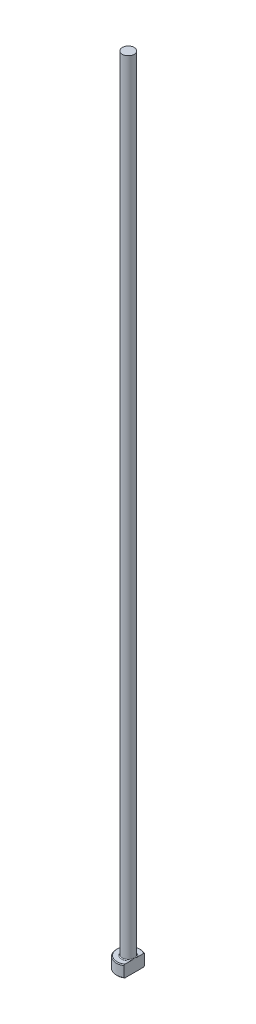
ISO-10303-21;
HEADER;
FILE_DESCRIPTION(('STEP AP214'),'2;1');
FILE_NAME('part.step','',(''),(''),'','','');
FILE_SCHEMA(('AUTOMOTIVE_DESIGN { 1 0 10303 214 1 1 1 1 }'));
ENDSEC;
DATA;
#1=APPLICATION_CONTEXT('core data for automotive mechanical design processes');
#2=APPLICATION_PROTOCOL_DEFINITION('international standard','automotive_design',2000,#1);
#3=PRODUCT_CONTEXT('',#1,'mechanical');
#4=PRODUCT('Part','Part','',(#3));
#5=PRODUCT_RELATED_PRODUCT_CATEGORY('part','',(#4));
#6=PRODUCT_DEFINITION_FORMATION('','',#4);
#7=PRODUCT_DEFINITION_CONTEXT('part definition',#1,'design');
#8=PRODUCT_DEFINITION('design','',#6,#7);
#9=PRODUCT_DEFINITION_SHAPE('','',#8);
#10=(LENGTH_UNIT() NAMED_UNIT(*) SI_UNIT(.MILLI.,.METRE.));
#11=(NAMED_UNIT(*) PLANE_ANGLE_UNIT() SI_UNIT($,.RADIAN.));
#12=(NAMED_UNIT(*) SI_UNIT($,.STERADIAN.) SOLID_ANGLE_UNIT());
#13=UNCERTAINTY_MEASURE_WITH_UNIT(LENGTH_MEASURE(1.E-05),#10,'distance_accuracy_value','');
#14=(GEOMETRIC_REPRESENTATION_CONTEXT(3) GLOBAL_UNCERTAINTY_ASSIGNED_CONTEXT((#13)) GLOBAL_UNIT_ASSIGNED_CONTEXT((#10,
#11,#12)) REPRESENTATION_CONTEXT('',''));
#15=CARTESIAN_POINT('',(0.,0.,0.));
#16=DIRECTION('',(0.,0.,1.));
#17=DIRECTION('',(1.,0.,0.));
#18=AXIS2_PLACEMENT_3D('',#15,#16,#17);
#19=CARTESIAN_POINT('',(0.,0.,0.));
#20=DIRECTION('',(0.,-1.,0.));
#21=DIRECTION('',(0.,0.,-1.));
#22=AXIS2_PLACEMENT_3D('',#19,#20,#21);
#23=PLANE('',#22);
#24=CARTESIAN_POINT('',(0.,0.,0.));
#25=DIRECTION('',(0.,-1.,0.));
#26=DIRECTION('',(0.,0.,-1.));
#27=AXIS2_PLACEMENT_3D('',#24,#25,#26);
#28=CIRCLE('',#27,2.79999999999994);
#29=CARTESIAN_POINT('',(1.49999999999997,0.,2.36431808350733));
#30=VERTEX_POINT('',#29);
#31=CARTESIAN_POINT('',(1.49999999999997,0.,-2.36431808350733));
#32=VERTEX_POINT('',#31);
#33=EDGE_CURVE('E98',#30,#32,#28,.T.);
#34=ORIENTED_EDGE('',*,*,#33,.T.);
#35=DIRECTION('',(0.,0.,1.));
#36=VECTOR('',#35,1.);
#37=CARTESIAN_POINT('',(1.49999999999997,0.,-2.5980762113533));
#38=LINE('',#37,#36);
#39=EDGE_CURVE('E83',#32,#30,#38,.T.);
#40=ORIENTED_EDGE('',*,*,#39,.T.);
#41=EDGE_LOOP('',(#34,#40));
#42=FACE_BOUND('',#41,.T.);
#43=ADVANCED_FACE('F32',(#42),#23,.T.);
#44=CARTESIAN_POINT('',(0.,259.958771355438,0.));
#45=DIRECTION('',(0.,1.,0.));
#46=DIRECTION('',(0.,0.,1.));
#47=AXIS2_PLACEMENT_3D('',#44,#45,#46);
#48=CYLINDRICAL_SURFACE('',#47,2.99999999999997);
#49=CARTESIAN_POINT('',(0.,2.79999999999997,0.));
#50=DIRECTION('',(0.,1.,0.));
#51=DIRECTION('',(0.,0.,1.));
#52=AXIS2_PLACEMENT_3D('',#49,#50,#51);
#53=CIRCLE('',#52,2.99999999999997);
#54=CARTESIAN_POINT('',(1.49999999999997,2.79999999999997,2.5980762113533));
#55=VERTEX_POINT('',#54);
#56=CARTESIAN_POINT('',(1.49999999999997,2.79999999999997,-2.5980762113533));
#57=VERTEX_POINT('',#56);
#58=EDGE_CURVE('E104',#55,#57,#53,.F.);
#59=ORIENTED_EDGE('',*,*,#58,.T.);
#60=DIRECTION('',(0.,-1.,0.));
#61=VECTOR('',#60,1.);
#62=CARTESIAN_POINT('',(1.49999999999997,200.,-2.5980762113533));
#63=LINE('',#62,#61);
#64=CARTESIAN_POINT('',(1.49999999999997,0.200000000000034,-2.5980762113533));
#65=VERTEX_POINT('',#64);
#66=EDGE_CURVE('E183',#57,#65,#63,.T.);
#67=ORIENTED_EDGE('',*,*,#66,.T.);
#68=CARTESIAN_POINT('',(0.,0.200000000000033,0.));
#69=DIRECTION('',(0.,-1.,0.));
#70=DIRECTION('',(0.,0.,-1.));
#71=AXIS2_PLACEMENT_3D('',#68,#69,#70);
#72=CIRCLE('',#71,2.99999999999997);
#73=CARTESIAN_POINT('',(1.49999999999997,0.200000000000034,2.5980762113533));
#74=VERTEX_POINT('',#73);
#75=EDGE_CURVE('E100',#65,#74,#72,.F.);
#76=ORIENTED_EDGE('',*,*,#75,.T.);
#77=DIRECTION('',(0.,-1.,0.));
#78=VECTOR('',#77,1.);
#79=CARTESIAN_POINT('',(1.49999999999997,200.,2.5980762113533));
#80=LINE('',#79,#78);
#81=EDGE_CURVE('E93',#55,#74,#80,.T.);
#82=ORIENTED_EDGE('',*,*,#81,.F.);
#83=EDGE_LOOP('',(#59,#67,#76,#82));
#84=FACE_BOUND('',#83,.T.);
#85=ADVANCED_FACE('F158',(#84),#48,.T.);
#86=CARTESIAN_POINT('',(-2.99999999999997,3.,0.));
#87=DIRECTION('',(0.,1.,0.));
#88=DIRECTION('',(0.,0.,1.));
#89=AXIS2_PLACEMENT_3D('',#86,#87,#88);
#90=PLANE('',#89);
#91=CARTESIAN_POINT('',(0.,3.,0.));
#92=DIRECTION('',(0.,1.,0.));
#93=DIRECTION('',(0.,0.,1.));
#94=AXIS2_PLACEMENT_3D('',#91,#92,#93);
#95=CIRCLE('',#94,2.79999999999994);
#96=CARTESIAN_POINT('',(1.49999999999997,3.,-2.36431808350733));
#97=VERTEX_POINT('',#96);
#98=CARTESIAN_POINT('',(1.49999999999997,3.,2.36431808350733));
#99=VERTEX_POINT('',#98);
#100=EDGE_CURVE('E178',#97,#99,#95,.T.);
#101=ORIENTED_EDGE('',*,*,#100,.T.);
#102=DIRECTION('',(0.,0.,-1.));
#103=VECTOR('',#102,1.);
#104=CARTESIAN_POINT('',(1.49999999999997,3.,0.));
#105=LINE('',#104,#103);
#106=CARTESIAN_POINT('',(1.49999999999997,2.99999999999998,0.799999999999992));
#107=VERTEX_POINT('',#106);
#108=EDGE_CURVE('E57',#99,#107,#105,.T.);
#109=ORIENTED_EDGE('',*,*,#108,.T.);
#110=CARTESIAN_POINT('',(0.,3.,0.));
#111=DIRECTION('',(0.,1.,0.));
#112=DIRECTION('',(0.,0.,1.));
#113=AXIS2_PLACEMENT_3D('',#110,#111,#112);
#114=CIRCLE('',#113,1.69999999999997);
#115=CARTESIAN_POINT('',(1.49999999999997,2.99999999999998,-0.799999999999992));
#116=VERTEX_POINT('',#115);
#117=EDGE_CURVE('E107',#107,#116,#114,.F.);
#118=ORIENTED_EDGE('',*,*,#117,.T.);
#119=EDGE_CURVE('E136',#116,#97,#105,.T.);
#120=ORIENTED_EDGE('',*,*,#119,.T.);
#121=EDGE_LOOP('',(#101,#109,#118,#120));
#122=FACE_BOUND('',#121,.T.);
#123=ADVANCED_FACE('F147',(#122),#90,.T.);
#124=CARTESIAN_POINT('',(0.,3.,0.));
#125=DIRECTION('',(0.,-1.,0.));
#126=DIRECTION('',(0.,0.,-1.));
#127=AXIS2_PLACEMENT_3D('',#124,#125,#126);
#128=CONICAL_SURFACE('',#127,2.79999999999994,0.785398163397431);
#129=ORIENTED_EDGE('',*,*,#58,.F.);
#130=CARTESIAN_POINT('',(1.49999999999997,-0.11174109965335,5.71827621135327));
#131=CARTESIAN_POINT('',(1.49999999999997,0.0136183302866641,5.58866816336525));
#132=CARTESIAN_POINT('',(1.49999999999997,0.138843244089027,5.45892957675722));
#133=CARTESIAN_POINT('',(1.49999999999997,0.388944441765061,5.19911365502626));
#134=CARTESIAN_POINT('',(1.49999999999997,0.513820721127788,5.06903631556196));
#135=CARTESIAN_POINT('',(1.49999999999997,0.763205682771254,4.80840180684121));
#136=CARTESIAN_POINT('',(1.49999999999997,0.887714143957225,4.67784442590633));
#137=CARTESIAN_POINT('',(1.49999999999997,1.13618059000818,4.4162081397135));
#138=CARTESIAN_POINT('',(1.49999999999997,1.26013857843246,4.28512923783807));
#139=CARTESIAN_POINT('',(1.49999999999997,1.50488975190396,4.02490837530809));
#140=CARTESIAN_POINT('',(1.49999999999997,1.62569693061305,3.8957795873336));
#141=CARTESIAN_POINT('',(1.49999999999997,1.86640694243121,3.63668213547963));
#142=CARTESIAN_POINT('',(1.49999999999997,1.98630978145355,3.50671347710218));
#143=CARTESIAN_POINT('',(1.49999999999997,2.2248603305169,3.24567921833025));
#144=CARTESIAN_POINT('',(1.49999999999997,2.3435083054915,3.11461386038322));
#145=CARTESIAN_POINT('',(1.49999999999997,2.5790771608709,2.85094268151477));
#146=CARTESIAN_POINT('',(1.49999999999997,2.69599811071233,2.71833692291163));
#147=CARTESIAN_POINT('',(1.49999999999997,2.88262371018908,2.50255231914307));
#148=CARTESIAN_POINT('',(1.49999999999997,2.95312454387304,2.42006293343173));
#149=CARTESIAN_POINT('',(1.49999999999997,3.09287098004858,2.25401084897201));
#150=CARTESIAN_POINT('',(1.49999999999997,3.16211645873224,2.17044804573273));
#151=CARTESIAN_POINT('',(1.49999999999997,3.29964684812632,2.00105967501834));
#152=CARTESIAN_POINT('',(1.49999999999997,3.36791386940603,1.9152195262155));
#153=CARTESIAN_POINT('',(1.49999999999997,3.50205840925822,1.7417139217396));
#154=CARTESIAN_POINT('',(1.49999999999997,3.56793649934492,1.65404891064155));
#155=CARTESIAN_POINT('',(1.49999999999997,3.69728151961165,1.47490236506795));
#156=CARTESIAN_POINT('',(1.49999999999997,3.76069661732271,1.38338308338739));
#157=CARTESIAN_POINT('',(1.49999999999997,3.88239539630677,1.19675661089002));
#158=CARTESIAN_POINT('',(1.49999999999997,3.94067201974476,1.10164473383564));
#159=CARTESIAN_POINT('',(1.49999999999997,4.048413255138,0.908008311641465));
#160=CARTESIAN_POINT('',(1.49999999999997,4.09797809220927,0.809540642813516));
#161=CARTESIAN_POINT('',(1.49999999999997,4.18432188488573,0.60719295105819));
#162=CARTESIAN_POINT('',(1.49999999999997,4.22114374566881,0.503332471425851));
#163=CARTESIAN_POINT('',(1.49999999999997,4.26099935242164,0.3475775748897));
#164=CARTESIAN_POINT('',(1.49999999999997,4.2715702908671,0.297609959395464));
#165=CARTESIAN_POINT('',(1.49999999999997,4.28794860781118,0.196885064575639));
#166=CARTESIAN_POINT('',(1.49999999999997,4.29375640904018,0.146127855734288));
#167=CARTESIAN_POINT('',(1.49999999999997,4.30019707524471,0.0444388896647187));
#168=CARTESIAN_POINT('',(1.49999999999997,4.30084594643,-0.00649183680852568));
#169=CARTESIAN_POINT('',(1.49999999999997,4.29696416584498,-0.108155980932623));
#170=CARTESIAN_POINT('',(1.49999999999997,4.29243308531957,-0.158889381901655));
#171=CARTESIAN_POINT('',(1.49999999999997,4.27856915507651,-0.259234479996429));
#172=CARTESIAN_POINT('',(1.49999999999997,4.2692782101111,-0.308852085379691));
#173=CARTESIAN_POINT('',(1.49999999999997,4.24647108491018,-0.407110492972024));
#174=CARTESIAN_POINT('',(1.49999999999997,4.23295324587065,-0.45575090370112));
#175=CARTESIAN_POINT('',(1.49999999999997,4.20226175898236,-0.55214996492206));
#176=CARTESIAN_POINT('',(1.49999999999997,4.18506801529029,-0.599902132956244));
#177=CARTESIAN_POINT('',(1.49999999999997,4.14771387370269,-0.694205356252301));
#178=CARTESIAN_POINT('',(1.49999999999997,4.12755408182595,-0.740756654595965));
#179=CARTESIAN_POINT('',(1.49999999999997,4.0632769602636,-0.879166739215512));
#180=CARTESIAN_POINT('',(1.49999999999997,4.01551721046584,-0.969329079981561));
#181=CARTESIAN_POINT('',(1.49999999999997,3.91367909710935,-1.14604316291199));
#182=CARTESIAN_POINT('',(1.49999999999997,3.85959300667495,-1.2325903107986));
#183=CARTESIAN_POINT('',(1.49999999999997,3.74697968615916,-1.40321348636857));
#184=CARTESIAN_POINT('',(1.49999999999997,3.68843573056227,-1.4872783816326));
#185=CARTESIAN_POINT('',(1.49999999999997,3.5684384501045,-1.65322187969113));
#186=CARTESIAN_POINT('',(1.49999999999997,3.50698656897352,-1.73510153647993));
#187=CARTESIAN_POINT('',(1.49999999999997,3.3811567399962,-1.89829823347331));
#188=CARTESIAN_POINT('',(1.49999999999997,3.31675092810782,-1.97959369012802));
#189=CARTESIAN_POINT('',(1.49999999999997,3.18634068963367,-2.14090082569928));
#190=CARTESIAN_POINT('',(1.49999999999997,3.12033609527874,-2.22091236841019));
#191=CARTESIAN_POINT('',(1.49999999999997,2.92086431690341,-2.45906508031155));
#192=CARTESIAN_POINT('',(1.49999999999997,2.78562663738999,-2.61572090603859));
#193=CARTESIAN_POINT('',(1.49999999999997,2.53554498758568,-2.90006295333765));
#194=CARTESIAN_POINT('',(1.49999999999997,2.42114543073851,-3.02814382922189));
#195=CARTESIAN_POINT('',(1.49999999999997,2.1909355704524,-3.28303767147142));
#196=CARTESIAN_POINT('',(1.49999999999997,2.07512522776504,-3.40985060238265));
#197=CARTESIAN_POINT('',(1.49999999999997,1.72597067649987,-3.78913849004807));
#198=CARTESIAN_POINT('',(1.49999999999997,1.49111760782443,-4.04022177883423));
#199=CARTESIAN_POINT('',(1.49999999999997,1.0288247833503,-4.52992803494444));
#200=CARTESIAN_POINT('',(1.49999999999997,0.801477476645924,-4.76863870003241));
#201=CARTESIAN_POINT('',(1.49999999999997,0.459548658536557,-5.12558036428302));
#202=CARTESIAN_POINT('',(1.49999999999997,0.345484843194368,-5.24430773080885));
#203=CARTESIAN_POINT('',(1.49999999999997,0.117071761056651,-5.48148573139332));
#204=CARTESIAN_POINT('',(1.49999999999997,0.00272249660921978,-5.59993636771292));
#205=CARTESIAN_POINT('',(1.49999999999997,-0.11174109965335,-5.71827621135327));
#206=B_SPLINE_CURVE_WITH_KNOTS('',3,(#130,#131,#132,#133,#134,#135,#136,#137,#138,#139,#140,
#141,#142,#143,#144,#145,#146,#147,#148,#149,#150,#151,#152,#153,#154,#155,#156,#157,#158,#159,
#160,#161,#162,#163,#164,#165,#166,#167,#168,#169,#170,#171,#172,#173,#174,#175,#176,#177,#178,
#179,#180,#181,#182,#183,#184,#185,#186,#187,#188,#189,#190,#191,#192,#193,#194,#195,#196,#197,
#198,#199,#200,#201,#202,#203,#204,#205),.UNSPECIFIED.,.F.,.F.,(4,2,2,2,2,2,2,2,2,2,2,2,2,2,2,2,
2,2,2,2,2,2,2,2,2,2,2,2,2,2,2,2,2,2,2,2,2,4),(0.,0.540943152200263,1.08189327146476,
1.62312052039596,2.16434426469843,2.69482920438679,3.22531067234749,3.75567781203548,
4.28602356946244,4.61155053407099,4.9371094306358,5.26610945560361,5.59503024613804,
5.92894782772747,6.26331713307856,6.59354403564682,6.92264800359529,7.07567478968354,
7.2286879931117,7.38122626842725,7.53377717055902,7.6850075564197,7.83629736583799,
7.98843643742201,8.14054446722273,8.44618799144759,8.75220879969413,9.05944044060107,
9.3665211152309,9.6776428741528,9.98879742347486,10.609592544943,11.1247803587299,
11.6399825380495,12.6713544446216,13.6603005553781,14.1542238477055,14.6481430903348),.UNSPECIFIED.);
#207=EDGE_CURVE('E135',#55,#99,#206,.T.);
#208=ORIENTED_EDGE('',*,*,#207,.T.);
#209=ORIENTED_EDGE('',*,*,#100,.F.);
#210=EDGE_CURVE('E127',#97,#57,#206,.T.);
#211=ORIENTED_EDGE('',*,*,#210,.T.);
#212=EDGE_LOOP('',(#129,#208,#209,#211));
#213=FACE_BOUND('',#212,.T.);
#214=ADVANCED_FACE('F143',(#213),#128,.T.);
#215=CARTESIAN_POINT('',(0.,0.200000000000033,0.));
#216=DIRECTION('',(0.,1.,0.));
#217=DIRECTION('',(0.,0.,1.));
#218=AXIS2_PLACEMENT_3D('',#215,#216,#217);
#219=CONICAL_SURFACE('',#218,2.99999999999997,0.785398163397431);
#220=ORIENTED_EDGE('',*,*,#75,.F.);
#221=CARTESIAN_POINT('',(1.49999999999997,3.11174109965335,-5.71827621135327));
#222=CARTESIAN_POINT('',(1.49999999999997,2.98638166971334,-5.58866816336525));
#223=CARTESIAN_POINT('',(1.49999999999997,2.86115675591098,-5.45892957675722));
#224=CARTESIAN_POINT('',(1.49999999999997,2.61105555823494,-5.19911365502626));
#225=CARTESIAN_POINT('',(1.49999999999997,2.48617927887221,-5.06903631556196));
#226=CARTESIAN_POINT('',(1.49999999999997,2.23679431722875,-4.80840180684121));
#227=CARTESIAN_POINT('',(1.49999999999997,2.11228585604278,-4.67784442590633));
#228=CARTESIAN_POINT('',(1.49999999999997,1.86381940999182,-4.4162081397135));
#229=CARTESIAN_POINT('',(1.49999999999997,1.73986142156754,-4.28512923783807));
#230=CARTESIAN_POINT('',(1.49999999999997,1.49511024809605,-4.02490837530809));
#231=CARTESIAN_POINT('',(1.49999999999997,1.37430306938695,-3.8957795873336));
#232=CARTESIAN_POINT('',(1.49999999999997,1.13359305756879,-3.63668213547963));
#233=CARTESIAN_POINT('',(1.49999999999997,1.01369021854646,-3.50671347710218));
#234=CARTESIAN_POINT('',(1.49999999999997,0.775139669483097,-3.24567921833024));
#235=CARTESIAN_POINT('',(1.49999999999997,0.656491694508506,-3.11461386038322));
#236=CARTESIAN_POINT('',(1.49999999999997,0.420922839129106,-2.85094268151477));
#237=CARTESIAN_POINT('',(1.49999999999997,0.304001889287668,-2.71833692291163));
#238=CARTESIAN_POINT('',(1.49999999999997,0.117376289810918,-2.50255231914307));
#239=CARTESIAN_POINT('',(1.49999999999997,0.0468754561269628,-2.42006293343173));
#240=CARTESIAN_POINT('',(1.49999999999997,-0.0928709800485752,-2.254010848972));
#241=CARTESIAN_POINT('',(1.49999999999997,-0.162116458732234,-2.17044804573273));
#242=CARTESIAN_POINT('',(1.49999999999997,-0.299646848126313,-2.00105967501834));
#243=CARTESIAN_POINT('',(1.49999999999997,-0.367913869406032,-1.9152195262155));
#244=CARTESIAN_POINT('',(1.49999999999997,-0.502058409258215,-1.7417139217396));
#245=CARTESIAN_POINT('',(1.49999999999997,-0.567936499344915,-1.65404891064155));
#246=CARTESIAN_POINT('',(1.49999999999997,-0.697281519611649,-1.47490236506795));
#247=CARTESIAN_POINT('',(1.49999999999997,-0.760696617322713,-1.38338308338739));
#248=CARTESIAN_POINT('',(1.49999999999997,-0.882395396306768,-1.19675661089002));
#249=CARTESIAN_POINT('',(1.49999999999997,-0.940672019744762,-1.10164473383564));
#250=CARTESIAN_POINT('',(1.49999999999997,-1.04841325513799,-0.908008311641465));
#251=CARTESIAN_POINT('',(1.49999999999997,-1.09797809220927,-0.809540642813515));
#252=CARTESIAN_POINT('',(1.49999999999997,-1.18432188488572,-0.607192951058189));
#253=CARTESIAN_POINT('',(1.49999999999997,-1.22114374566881,-0.503332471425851));
#254=CARTESIAN_POINT('',(1.49999999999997,-1.26099935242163,-0.3475775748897));
#255=CARTESIAN_POINT('',(1.49999999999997,-1.2715702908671,-0.297609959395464));
#256=CARTESIAN_POINT('',(1.49999999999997,-1.28794860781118,-0.19688506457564));
#257=CARTESIAN_POINT('',(1.49999999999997,-1.29375640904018,-0.146127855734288));
#258=CARTESIAN_POINT('',(1.49999999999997,-1.30019707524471,-0.0444388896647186));
#259=CARTESIAN_POINT('',(1.49999999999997,-1.30084594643,0.00649183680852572));
#260=CARTESIAN_POINT('',(1.49999999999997,-1.29696416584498,0.108155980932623));
#261=CARTESIAN_POINT('',(1.49999999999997,-1.29243308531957,0.158889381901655));
#262=CARTESIAN_POINT('',(1.49999999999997,-1.2785691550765,0.259234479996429));
#263=CARTESIAN_POINT('',(1.49999999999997,-1.2692782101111,0.308852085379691));
#264=CARTESIAN_POINT('',(1.49999999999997,-1.24647108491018,0.407110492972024));
#265=CARTESIAN_POINT('',(1.49999999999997,-1.23295324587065,0.45575090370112));
#266=CARTESIAN_POINT('',(1.49999999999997,-1.20226175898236,0.55214996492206));
#267=CARTESIAN_POINT('',(1.49999999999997,-1.18506801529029,0.599902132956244));
#268=CARTESIAN_POINT('',(1.49999999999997,-1.14771387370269,0.694205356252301));
#269=CARTESIAN_POINT('',(1.49999999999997,-1.12755408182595,0.740756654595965));
#270=CARTESIAN_POINT('',(1.49999999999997,-1.0632769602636,0.879166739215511));
#271=CARTESIAN_POINT('',(1.49999999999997,-1.01551721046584,0.96932907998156));
#272=CARTESIAN_POINT('',(1.49999999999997,-0.913679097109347,1.14604316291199));
#273=CARTESIAN_POINT('',(1.49999999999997,-0.85959300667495,1.2325903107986));
#274=CARTESIAN_POINT('',(1.49999999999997,-0.74697968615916,1.40321348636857));
#275=CARTESIAN_POINT('',(1.49999999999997,-0.688435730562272,1.4872783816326));
#276=CARTESIAN_POINT('',(1.49999999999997,-0.568438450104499,1.65322187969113));
#277=CARTESIAN_POINT('',(1.49999999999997,-0.50698656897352,1.73510153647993));
#278=CARTESIAN_POINT('',(1.49999999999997,-0.381156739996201,1.89829823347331));
#279=CARTESIAN_POINT('',(1.49999999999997,-0.316750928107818,1.97959369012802));
#280=CARTESIAN_POINT('',(1.49999999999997,-0.186340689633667,2.14090082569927));
#281=CARTESIAN_POINT('',(1.49999999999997,-0.120336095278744,2.22091236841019));
#282=CARTESIAN_POINT('',(1.49999999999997,0.0791356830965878,2.45906508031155));
#283=CARTESIAN_POINT('',(1.49999999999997,0.214373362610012,2.61572090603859));
#284=CARTESIAN_POINT('',(1.49999999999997,0.464455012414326,2.90006295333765));
#285=CARTESIAN_POINT('',(1.49999999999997,0.578854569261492,3.02814382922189));
#286=CARTESIAN_POINT('',(1.49999999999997,0.809064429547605,3.28303767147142));
#287=CARTESIAN_POINT('',(1.49999999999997,0.924874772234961,3.40985060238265));
#288=CARTESIAN_POINT('',(1.49999999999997,1.27402932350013,3.78913849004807));
#289=CARTESIAN_POINT('',(1.49999999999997,1.50888239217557,4.04022177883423));
#290=CARTESIAN_POINT('',(1.49999999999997,1.97117521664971,4.52992803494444));
#291=CARTESIAN_POINT('',(1.49999999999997,2.19852252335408,4.76863870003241));
#292=CARTESIAN_POINT('',(1.49999999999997,2.54045134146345,5.12558036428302));
#293=CARTESIAN_POINT('',(1.49999999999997,2.65451515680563,5.24430773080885));
#294=CARTESIAN_POINT('',(1.49999999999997,2.88292823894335,5.48148573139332));
#295=CARTESIAN_POINT('',(1.49999999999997,2.99727750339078,5.59993636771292));
#296=CARTESIAN_POINT('',(1.49999999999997,3.11174109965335,5.71827621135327));
#297=B_SPLINE_CURVE_WITH_KNOTS('',3,(#221,#222,#223,#224,#225,#226,#227,#228,#229,#230,#231,
#232,#233,#234,#235,#236,#237,#238,#239,#240,#241,#242,#243,#244,#245,#246,#247,#248,#249,#250,
#251,#252,#253,#254,#255,#256,#257,#258,#259,#260,#261,#262,#263,#264,#265,#266,#267,#268,#269,
#270,#271,#272,#273,#274,#275,#276,#277,#278,#279,#280,#281,#282,#283,#284,#285,#286,#287,#288,
#289,#290,#291,#292,#293,#294,#295,#296),.UNSPECIFIED.,.F.,.F.,(4,2,2,2,2,2,2,2,2,2,2,2,2,2,2,2,
2,2,2,2,2,2,2,2,2,2,2,2,2,2,2,2,2,2,2,2,2,4),(0.,0.540943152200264,1.08189327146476,
1.62312052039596,2.16434426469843,2.69482920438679,3.22531067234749,3.75567781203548,
4.28602356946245,4.611550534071,4.9371094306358,5.26610945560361,5.59503024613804,
5.92894782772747,6.26331713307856,6.59354403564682,6.92264800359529,7.07567478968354,
7.2286879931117,7.38122626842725,7.53377717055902,7.6850075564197,7.83629736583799,
7.98843643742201,8.14054446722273,8.44618799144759,8.75220879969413,9.05944044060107,
9.3665211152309,9.6776428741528,9.98879742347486,10.609592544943,11.1247803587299,
11.6399825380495,12.6713544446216,13.6603005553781,14.1542238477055,14.6481430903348),.UNSPECIFIED.);
#298=EDGE_CURVE('E86',#65,#32,#297,.T.);
#299=ORIENTED_EDGE('',*,*,#298,.T.);
#300=ORIENTED_EDGE('',*,*,#33,.F.);
#301=EDGE_CURVE('E89',#30,#74,#297,.T.);
#302=ORIENTED_EDGE('',*,*,#301,.T.);
#303=EDGE_LOOP('',(#220,#299,#300,#302));
#304=FACE_BOUND('',#303,.T.);
#305=ADVANCED_FACE('F97',(#304),#219,.T.);
#306=CARTESIAN_POINT('',(0.,3.19999999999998,0.));
#307=DIRECTION('',(0.,1.,0.));
#308=DIRECTION('',(0.,0.,1.));
#309=AXIS2_PLACEMENT_3D('',#306,#307,#308);
#310=TOROIDAL_SURFACE('',#309,1.69999999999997,0.2);
#311=CARTESIAN_POINT('',(1.49999999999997,3.19999999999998,0.));
#312=CARTESIAN_POINT('',(1.49999999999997,3.20000050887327,7.14686524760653E-11));
#313=CARTESIAN_POINT('',(1.49999999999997,3.20000101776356,-1.21663671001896E-07));
#314=CARTESIAN_POINT('',(1.49999999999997,3.20000199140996,-4.97616231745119E-07));
#315=CARTESIAN_POINT('',(1.49999999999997,3.20000245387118,-7.56516213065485E-07));
#316=CARTESIAN_POINT('',(1.49999999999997,3.20000338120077,-1.37642836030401E-06));
#317=CARTESIAN_POINT('',(1.49999999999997,3.20000384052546,-1.74563475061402E-06));
#318=CARTESIAN_POINT('',(1.49999999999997,3.20000469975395,-2.53565983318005E-06));
#319=CARTESIAN_POINT('',(1.49999999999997,3.20000510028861,-2.95582595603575E-06));
#320=CARTESIAN_POINT('',(1.49999999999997,3.20000646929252,-4.48430443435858E-06));
#321=CARTESIAN_POINT('',(1.49999999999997,3.20000736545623,-5.6586103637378E-06));
#322=CARTESIAN_POINT('',(1.49999999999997,3.20000893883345,-8.06479198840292E-06));
#323=CARTESIAN_POINT('',(1.49999999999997,3.20000962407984,-9.29170513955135E-06));
#324=CARTESIAN_POINT('',(1.49999999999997,3.2000122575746,-1.41623288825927E-05));
#325=CARTESIAN_POINT('',(1.49999999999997,3.20001407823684,-1.78790031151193E-05));
#326=CARTESIAN_POINT('',(1.49999999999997,3.20001699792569,-2.51443065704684E-05));
#327=CARTESIAN_POINT('',(1.49999999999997,3.20001815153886,-2.86715393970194E-05));
#328=CARTESIAN_POINT('',(1.49999999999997,3.20002315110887,-4.39218127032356E-05));
#329=CARTESIAN_POINT('',(1.49999999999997,3.2000270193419,-5.56288388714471E-05));
#330=CARTESIAN_POINT('',(1.49999999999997,3.20003312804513,-7.74058287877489E-05));
#331=CARTESIAN_POINT('',(1.49999999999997,3.20003553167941,-8.7427840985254E-05));
#332=CARTESIAN_POINT('',(1.49999999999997,3.20005483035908,-0.00016122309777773));
#333=CARTESIAN_POINT('',(1.49999999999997,3.2000797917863,-0.000222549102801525));
#334=CARTESIAN_POINT('',(1.49999999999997,3.20017391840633,-0.000462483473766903));
#335=CARTESIAN_POINT('',(1.49999999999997,3.20023706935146,-0.000642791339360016));
#336=CARTESIAN_POINT('',(1.49999999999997,3.20048761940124,-0.00134785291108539));
#337=CARTESIAN_POINT('',(1.49999999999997,3.20068132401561,-0.00187087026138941));
#338=CARTESIAN_POINT('',(1.49999999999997,3.20147357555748,-0.0040200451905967));
#339=CARTESIAN_POINT('',(1.49999999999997,3.20206499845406,-0.00564811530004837));
#340=CARTESIAN_POINT('',(1.49999999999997,3.2089263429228,-0.0245232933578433));
#341=CARTESIAN_POINT('',(1.49999999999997,3.21523683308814,-0.0417598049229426));
#342=CARTESIAN_POINT('',(1.49999999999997,3.22755028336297,-0.0756091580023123));
#343=CARTESIAN_POINT('',(1.49999999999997,3.23355589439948,-0.0922211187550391));
#344=CARTESIAN_POINT('',(1.49999999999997,3.2462010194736,-0.127454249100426));
#345=CARTESIAN_POINT('',(1.49999999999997,3.25283080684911,-0.146078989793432));
#346=CARTESIAN_POINT('',(1.49999999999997,3.26599765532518,-0.183577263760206));
#347=CARTESIAN_POINT('',(1.49999999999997,3.2725330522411,-0.202451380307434));
#348=CARTESIAN_POINT('',(1.49999999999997,3.28834228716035,-0.248982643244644));
#349=CARTESIAN_POINT('',(1.49999999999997,3.29749152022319,-0.276682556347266));
#350=CARTESIAN_POINT('',(1.49999999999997,3.3149093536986,-0.331625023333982));
#351=CARTESIAN_POINT('',(1.49999999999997,3.32319386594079,-0.358862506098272));
#352=CARTESIAN_POINT('',(1.49999999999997,3.34051594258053,-0.419125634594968));
#353=CARTESIAN_POINT('',(1.49999999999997,3.34936607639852,-0.452206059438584));
#354=CARTESIAN_POINT('',(1.49999999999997,3.36549583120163,-0.519023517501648));
#355=CARTESIAN_POINT('',(1.49999999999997,3.37276283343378,-0.552763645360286));
#356=CARTESIAN_POINT('',(1.49999999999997,3.38554755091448,-0.623053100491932));
#357=CARTESIAN_POINT('',(1.49999999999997,3.39090573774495,-0.659632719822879));
#358=CARTESIAN_POINT('',(1.49999999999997,3.39825016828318,-0.733028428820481));
#359=CARTESIAN_POINT('',(1.49999999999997,3.40024734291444,-0.769843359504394));
#360=CARTESIAN_POINT('',(1.49999999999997,3.39970780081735,-0.842856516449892));
#361=CARTESIAN_POINT('',(1.49999999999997,3.39725347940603,-0.87905368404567));
#362=CARTESIAN_POINT('',(1.49999999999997,3.38900085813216,-0.932380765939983));
#363=CARTESIAN_POINT('',(1.49999999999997,3.38553049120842,-0.949868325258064));
#364=CARTESIAN_POINT('',(1.49999999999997,3.37678336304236,-0.98437493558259));
#365=CARTESIAN_POINT('',(1.49999999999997,3.37150943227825,-1.00139467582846));
#366=CARTESIAN_POINT('',(1.49999999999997,3.35869781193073,-1.03479423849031));
#367=CARTESIAN_POINT('',(1.49999999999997,3.3511359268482,-1.05116499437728));
#368=CARTESIAN_POINT('',(1.49999999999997,3.33325333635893,-1.08234828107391));
#369=CARTESIAN_POINT('',(1.49999999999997,3.32294266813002,-1.097166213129));
#370=CARTESIAN_POINT('',(1.49999999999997,3.30512758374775,-1.11714173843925));
#371=CARTESIAN_POINT('',(1.49999999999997,3.29884721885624,-1.1233906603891));
#372=CARTESIAN_POINT('',(1.49999999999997,3.28545950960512,-1.13494695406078));
#373=CARTESIAN_POINT('',(1.49999999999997,3.27835226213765,-1.14025443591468));
#374=CARTESIAN_POINT('',(1.49999999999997,3.26325970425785,-1.14967631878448));
#375=CARTESIAN_POINT('',(1.49999999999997,3.25526534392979,-1.1537764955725));
#376=CARTESIAN_POINT('',(1.49999999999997,3.23863207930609,-1.16034952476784));
#377=CARTESIAN_POINT('',(1.49999999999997,3.22999427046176,-1.16282507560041));
#378=CARTESIAN_POINT('',(1.49999999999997,3.21343922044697,-1.16570267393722));
#379=CARTESIAN_POINT('',(1.49999999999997,3.20555896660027,-1.16631687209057));
#380=CARTESIAN_POINT('',(1.49999999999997,3.18982775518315,-1.16602054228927));
#381=CARTESIAN_POINT('',(1.49999999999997,3.18197679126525,-1.16511036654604));
#382=CARTESIAN_POINT('',(1.49999999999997,3.16747846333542,-1.16204446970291));
#383=CARTESIAN_POINT('',(1.49999999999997,3.16079696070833,-1.16004509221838));
#384=CARTESIAN_POINT('',(1.49999999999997,3.14781700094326,-1.15505972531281));
#385=CARTESIAN_POINT('',(1.49999999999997,3.14151862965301,-1.1520735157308));
#386=CARTESIAN_POINT('',(1.49999999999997,3.12690214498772,-1.14387585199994));
#387=CARTESIAN_POINT('',(1.49999999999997,3.11881436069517,-1.13825400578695));
#388=CARTESIAN_POINT('',(1.49999999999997,3.1036444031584,-1.12578441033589));
#389=CARTESIAN_POINT('',(1.49999999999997,3.09656475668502,-1.11893367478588));
#390=CARTESIAN_POINT('',(1.49999999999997,3.08012297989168,-1.10074342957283));
#391=CARTESIAN_POINT('',(1.49999999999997,3.07136543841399,-1.08886044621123));
#392=CARTESIAN_POINT('',(1.49999999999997,3.05578194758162,-1.06392743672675));
#393=CARTESIAN_POINT('',(1.49999999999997,3.0489571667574,-1.05087671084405));
#394=CARTESIAN_POINT('',(1.49999999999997,3.03273856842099,-1.0147230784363));
#395=CARTESIAN_POINT('',(1.49999999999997,3.02486230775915,-0.990945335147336));
#396=CARTESIAN_POINT('',(1.49999999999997,3.01257693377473,-0.942321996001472));
#397=CARTESIAN_POINT('',(1.49999999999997,3.00820590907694,-0.917467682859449));
#398=CARTESIAN_POINT('',(1.49999999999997,3.00229956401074,-0.867912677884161));
#399=CARTESIAN_POINT('',(1.49999999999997,3.0007128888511,-0.843217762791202));
#400=CARTESIAN_POINT('',(1.49999999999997,2.9996723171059,-0.793746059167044));
#401=CARTESIAN_POINT('',(1.49999999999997,3.0002230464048,-0.768969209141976));
#402=CARTESIAN_POINT('',(1.49999999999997,3.00433101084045,-0.696994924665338));
#403=CARTESIAN_POINT('',(1.49999999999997,3.01016976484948,-0.649931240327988));
#404=CARTESIAN_POINT('',(1.49999999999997,3.02567776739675,-0.559166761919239));
#405=CARTESIAN_POINT('',(1.49999999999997,3.03511950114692,-0.515423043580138));
#406=CARTESIAN_POINT('',(1.49999999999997,3.05693059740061,-0.427590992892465));
#407=CARTESIAN_POINT('',(1.49999999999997,3.0693635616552,-0.383518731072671));
#408=CARTESIAN_POINT('',(1.49999999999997,3.0917495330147,-0.310161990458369));
#409=CARTESIAN_POINT('',(1.49999999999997,3.1011984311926,-0.280718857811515));
#410=CARTESIAN_POINT('',(1.49999999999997,3.12060442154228,-0.22234098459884));
#411=CARTESIAN_POINT('',(1.49999999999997,3.13055519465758,-0.193404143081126));
#412=CARTESIAN_POINT('',(1.49999999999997,3.14973721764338,-0.1387568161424));
#413=CARTESIAN_POINT('',(1.49999999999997,3.15893123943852,-0.113033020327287));
#414=CARTESIAN_POINT('',(1.49999999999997,3.17788037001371,-0.0606351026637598));
#415=CARTESIAN_POINT('',(1.49999999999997,3.18764328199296,-0.0339636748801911));
#416=CARTESIAN_POINT('',(1.49999999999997,3.19793548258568,-0.00564657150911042));
#417=CARTESIAN_POINT('',(1.49999999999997,3.19852751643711,-0.00401699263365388));
#418=CARTESIAN_POINT('',(1.49999999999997,3.1993199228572,-0.00186745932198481));
#419=CARTESIAN_POINT('',(1.49999999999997,3.1995131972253,-0.00134559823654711));
#420=CARTESIAN_POINT('',(1.49999999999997,3.19976322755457,-0.000641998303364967));
#421=CARTESIAN_POINT('',(1.49999999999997,3.19982627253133,-0.000461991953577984));
#422=CARTESIAN_POINT('',(1.49999999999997,3.19992025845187,-0.000222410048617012));
#423=CARTESIAN_POINT('',(1.49999999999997,3.19994519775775,-0.000161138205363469));
#424=CARTESIAN_POINT('',(1.49999999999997,3.1999644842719,-8.74039265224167E-05));
#425=CARTESIAN_POINT('',(1.49999999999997,3.19996688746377,-7.73857554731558E-05));
#426=CARTESIAN_POINT('',(1.49999999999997,3.19997299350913,-5.56173270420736E-05));
#427=CARTESIAN_POINT('',(1.49999999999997,3.19997685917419,-4.39149185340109E-05));
#428=CARTESIAN_POINT('',(1.49999999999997,3.19998185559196,-2.86698156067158E-05));
#429=CARTESIAN_POINT('',(1.49999999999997,3.19998300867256,-2.51431574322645E-05));
#430=CARTESIAN_POINT('',(1.49999999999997,3.19998592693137,-1.78789551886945E-05));
#431=CARTESIAN_POINT('',(1.49999999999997,3.19998774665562,-1.41627846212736E-05));
#432=CARTESIAN_POINT('',(1.49999999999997,3.1999903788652,-9.29264485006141E-06));
#433=CARTESIAN_POINT('',(1.49999999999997,3.19999106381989,-8.06577596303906E-06));
#434=CARTESIAN_POINT('',(1.49999999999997,3.19999263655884,-5.65962636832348E-06));
#435=CARTESIAN_POINT('',(1.49999999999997,3.19999353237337,-4.48530463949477E-06));
#436=CARTESIAN_POINT('',(1.49999999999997,3.19999490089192,-2.95673739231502E-06));
#437=CARTESIAN_POINT('',(1.49999999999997,3.19999530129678,-2.53653206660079E-06));
#438=CARTESIAN_POINT('',(1.49999999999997,3.19999616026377,-1.74640524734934E-06));
#439=CARTESIAN_POINT('',(1.49999999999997,3.19999661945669,-1.37713597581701E-06));
#440=CARTESIAN_POINT('',(1.49999999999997,3.19999754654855,-7.57072329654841E-07));
#441=CARTESIAN_POINT('',(1.49999999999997,3.1999980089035,-4.98087382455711E-07));
#442=CARTESIAN_POINT('',(1.49999999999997,3.19999898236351,-1.21927247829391E-07));
#443=CARTESIAN_POINT('',(1.49999999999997,3.19999949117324,-7.14621145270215E-11));
#444=CARTESIAN_POINT('',(1.49999999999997,3.19999999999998,0.));
#445=B_SPLINE_CURVE_WITH_KNOTS('',3,(#311,#312,#313,#314,#315,#316,#317,#318,#319,#320,#321,
#322,#323,#324,#325,#326,#327,#328,#329,#330,#331,#332,#333,#334,#335,#336,#337,#338,#339,#340,
#341,#342,#343,#344,#345,#346,#347,#348,#349,#350,#351,#352,#353,#354,#355,#356,#357,#358,#359,
#360,#361,#362,#363,#364,#365,#366,#367,#368,#369,#370,#371,#372,#373,#374,#375,#376,#377,#378,
#379,#380,#381,#382,#383,#384,#385,#386,#387,#388,#389,#390,#391,#392,#393,#394,#395,#396,#397,
#398,#399,#400,#401,#402,#403,#404,#405,#406,#407,#408,#409,#410,#411,#412,#413,#414,#415,#416,
#417,#418,#419,#420,#421,#422,#423,#424,#425,#426,#427,#428,#429,#430,#431,#432,#433,#434,#435,
#436,#437,#438,#439,#440,#441,#442,#443,#444),.UNSPECIFIED.,.T.,.F.,(4,2,2,2,2,2,2,2,2,2,2,2,2,
2,2,2,2,2,2,2,2,2,2,2,2,2,2,2,2,2,2,2,2,2,2,2,2,2,2,2,2,2,2,2,2,2,2,2,2,2,2,2,2,2,2,2,2,2,2,2,2,
2,2,2,2,2,4),(0.,1.5268750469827E-06,3.1095939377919E-06,4.8697676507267E-06,
6.6094009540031E-06,1.1020252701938E-05,1.52327800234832E-05,2.76140373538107E-05,
3.87351647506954E-05,7.57188333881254E-05,0.000106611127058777,0.000304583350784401,
0.000878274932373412,0.00255078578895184,0.00774802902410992,0.0628090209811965,
0.115802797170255,0.175110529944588,0.235030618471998,0.322539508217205,0.407938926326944,
0.510638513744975,0.614128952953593,0.724918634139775,0.835347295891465,0.943752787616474,
0.997165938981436,1.05049564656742,1.10441029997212,1.1581307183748,1.18463966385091,
1.21114550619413,1.23795217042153,1.26471419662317,1.28828324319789,1.31184684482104,
1.33268332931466,1.35352446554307,1.38290826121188,1.41236445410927,1.45639976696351,
1.5004616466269,1.5751878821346,1.65071550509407,1.72483484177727,1.79911468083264,
1.94105061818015,2.07520625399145,2.21251544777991,2.30527614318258,2.3970705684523,
2.47902409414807,2.56422207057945,2.56942417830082,2.57109299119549,2.57166572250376,
2.57186352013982,2.57189440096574,2.57193136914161,2.5719424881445,2.5719548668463,
2.57195907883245,2.5719634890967,2.571965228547,2.57196698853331,2.5719685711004,
2.57197009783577),.UNSPECIFIED.);
#446=CARTESIAN_POINT('',(1.49999999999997,3.19999999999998,0.));
#447=VERTEX_POINT('',#446);
#448=EDGE_CURVE('E11',#116,#447,#445,.T.);
#449=ORIENTED_EDGE('',*,*,#448,.F.);
#450=ORIENTED_EDGE('',*,*,#117,.F.);
#451=CARTESIAN_POINT('',(1.49999999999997,3.19999999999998,0.));
#452=CARTESIAN_POINT('',(1.49999999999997,3.19999949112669,-7.14686931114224E-11));
#453=CARTESIAN_POINT('',(1.49999999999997,3.1999989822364,1.21663670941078E-07));
#454=CARTESIAN_POINT('',(1.49999999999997,3.19999800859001,4.97616231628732E-07));
#455=CARTESIAN_POINT('',(1.49999999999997,3.19999754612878,7.56516212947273E-07));
#456=CARTESIAN_POINT('',(1.49999999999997,3.19999661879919,1.37642836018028E-06));
#457=CARTESIAN_POINT('',(1.49999999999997,3.1999961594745,1.74563475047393E-06));
#458=CARTESIAN_POINT('',(1.49999999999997,3.19999530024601,2.53565983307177E-06));
#459=CARTESIAN_POINT('',(1.49999999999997,3.19999489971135,2.95582595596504E-06));
#460=CARTESIAN_POINT('',(1.49999999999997,3.19999353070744,4.48430443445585E-06));
#461=CARTESIAN_POINT('',(1.49999999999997,3.19999263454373,5.65861036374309E-06));
#462=CARTESIAN_POINT('',(1.49999999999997,3.19999106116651,8.06479198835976E-06));
#463=CARTESIAN_POINT('',(1.49999999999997,3.19999037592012,9.29170513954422E-06));
#464=CARTESIAN_POINT('',(1.49999999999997,3.19998774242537,1.41623288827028E-05));
#465=CARTESIAN_POINT('',(1.49999999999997,3.19998592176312,1.78790031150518E-05));
#466=CARTESIAN_POINT('',(1.49999999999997,3.19998300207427,2.51443065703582E-05));
#467=CARTESIAN_POINT('',(1.49999999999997,3.1999818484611,2.86715393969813E-05));
#468=CARTESIAN_POINT('',(1.49999999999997,3.19997684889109,4.39218127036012E-05));
#469=CARTESIAN_POINT('',(1.49999999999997,3.19997298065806,5.56288388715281E-05));
#470=CARTESIAN_POINT('',(1.49999999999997,3.19996687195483,7.7405828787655E-05));
#471=CARTESIAN_POINT('',(1.49999999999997,3.19996446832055,8.74278409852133E-05));
#472=CARTESIAN_POINT('',(1.49999999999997,3.19994516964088,0.000161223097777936));
#473=CARTESIAN_POINT('',(1.49999999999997,3.19992020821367,0.00022254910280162));
#474=CARTESIAN_POINT('',(1.49999999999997,3.19982608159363,0.000462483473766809));
#475=CARTESIAN_POINT('',(1.49999999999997,3.1997629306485,0.000642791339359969));
#476=CARTESIAN_POINT('',(1.49999999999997,3.19951238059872,0.00134785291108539));
#477=CARTESIAN_POINT('',(1.49999999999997,3.19931867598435,0.00187087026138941));
#478=CARTESIAN_POINT('',(1.49999999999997,3.19852642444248,0.0040200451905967));
#479=CARTESIAN_POINT('',(1.49999999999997,3.19793500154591,0.00564811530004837));
#480=CARTESIAN_POINT('',(1.49999999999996,3.19107365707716,0.0245232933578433));
#481=CARTESIAN_POINT('',(1.49999999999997,3.18476316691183,0.0417598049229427));
#482=CARTESIAN_POINT('',(1.49999999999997,3.17244971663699,0.0756091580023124));
#483=CARTESIAN_POINT('',(1.49999999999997,3.16644410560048,0.0922211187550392));
#484=CARTESIAN_POINT('',(1.49999999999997,3.15379898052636,0.127454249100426));
#485=CARTESIAN_POINT('',(1.49999999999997,3.14716919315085,0.146078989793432));
#486=CARTESIAN_POINT('',(1.49999999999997,3.13400234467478,0.183577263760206));
#487=CARTESIAN_POINT('',(1.49999999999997,3.12746694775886,0.202451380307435));
#488=CARTESIAN_POINT('',(1.49999999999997,3.11165771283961,0.248982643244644));
#489=CARTESIAN_POINT('',(1.49999999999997,3.10250847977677,0.276682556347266));
#490=CARTESIAN_POINT('',(1.49999999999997,3.08509064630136,0.331625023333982));
#491=CARTESIAN_POINT('',(1.49999999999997,3.07680613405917,0.358862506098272));
#492=CARTESIAN_POINT('',(1.49999999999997,3.05948405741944,0.419125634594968));
#493=CARTESIAN_POINT('',(1.49999999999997,3.05063392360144,0.452206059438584));
#494=CARTESIAN_POINT('',(1.49999999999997,3.03450416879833,0.519023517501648));
#495=CARTESIAN_POINT('',(1.49999999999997,3.02723716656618,0.552763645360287));
#496=CARTESIAN_POINT('',(1.49999999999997,3.01445244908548,0.623053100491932));
#497=CARTESIAN_POINT('',(1.49999999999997,3.00909426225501,0.659632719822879));
#498=CARTESIAN_POINT('',(1.49999999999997,3.00174983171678,0.733028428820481));
#499=CARTESIAN_POINT('',(1.49999999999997,2.99975265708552,0.769843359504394));
#500=CARTESIAN_POINT('',(1.49999999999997,3.00029219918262,0.842856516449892));
#501=CARTESIAN_POINT('',(1.49999999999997,3.00274652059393,0.87905368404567));
#502=CARTESIAN_POINT('',(1.49999999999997,3.0109991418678,0.932380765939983));
#503=CARTESIAN_POINT('',(1.49999999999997,3.01446950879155,0.949868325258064));
#504=CARTESIAN_POINT('',(1.49999999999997,3.02321663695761,0.98437493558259));
#505=CARTESIAN_POINT('',(1.49999999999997,3.02849056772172,1.00139467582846));
#506=CARTESIAN_POINT('',(1.49999999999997,3.04130218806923,1.03479423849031));
#507=CARTESIAN_POINT('',(1.49999999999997,3.04886407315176,1.05116499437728));
#508=CARTESIAN_POINT('',(1.49999999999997,3.06674666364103,1.08234828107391));
#509=CARTESIAN_POINT('',(1.49999999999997,3.07705733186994,1.097166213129));
#510=CARTESIAN_POINT('',(1.49999999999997,3.09487241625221,1.11714173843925));
#511=CARTESIAN_POINT('',(1.49999999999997,3.10115278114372,1.1233906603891));
#512=CARTESIAN_POINT('',(1.49999999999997,3.11454049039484,1.13494695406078));
#513=CARTESIAN_POINT('',(1.49999999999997,3.12164773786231,1.14025443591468));
#514=CARTESIAN_POINT('',(1.49999999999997,3.13674029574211,1.14967631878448));
#515=CARTESIAN_POINT('',(1.49999999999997,3.14473465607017,1.1537764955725));
#516=CARTESIAN_POINT('',(1.49999999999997,3.16136792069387,1.16034952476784));
#517=CARTESIAN_POINT('',(1.49999999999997,3.1700057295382,1.16282507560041));
#518=CARTESIAN_POINT('',(1.49999999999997,3.18656077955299,1.16570267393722));
#519=CARTESIAN_POINT('',(1.49999999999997,3.19444103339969,1.16631687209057));
#520=CARTESIAN_POINT('',(1.49999999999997,3.21017224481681,1.16602054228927));
#521=CARTESIAN_POINT('',(1.49999999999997,3.21802320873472,1.16511036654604));
#522=CARTESIAN_POINT('',(1.49999999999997,3.23252153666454,1.16204446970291));
#523=CARTESIAN_POINT('',(1.49999999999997,3.23920303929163,1.16004509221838));
#524=CARTESIAN_POINT('',(1.49999999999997,3.2521829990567,1.15505972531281));
#525=CARTESIAN_POINT('',(1.49999999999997,3.25848137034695,1.1520735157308));
#526=CARTESIAN_POINT('',(1.49999999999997,3.27309785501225,1.14387585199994));
#527=CARTESIAN_POINT('',(1.49999999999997,3.28118563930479,1.13825400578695));
#528=CARTESIAN_POINT('',(1.49999999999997,3.29635559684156,1.12578441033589));
#529=CARTESIAN_POINT('',(1.49999999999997,3.30343524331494,1.11893367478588));
#530=CARTESIAN_POINT('',(1.49999999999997,3.31987702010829,1.10074342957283));
#531=CARTESIAN_POINT('',(1.49999999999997,3.32863456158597,1.08886044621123));
#532=CARTESIAN_POINT('',(1.49999999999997,3.34421805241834,1.06392743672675));
#533=CARTESIAN_POINT('',(1.49999999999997,3.35104283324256,1.05087671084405));
#534=CARTESIAN_POINT('',(1.49999999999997,3.36726143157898,1.0147230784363));
#535=CARTESIAN_POINT('',(1.49999999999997,3.37513769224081,0.990945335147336));
#536=CARTESIAN_POINT('',(1.49999999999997,3.38742306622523,0.942321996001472));
#537=CARTESIAN_POINT('',(1.49999999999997,3.39179409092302,0.917467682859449));
#538=CARTESIAN_POINT('',(1.49999999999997,3.39770043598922,0.867912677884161));
#539=CARTESIAN_POINT('',(1.49999999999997,3.39928711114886,0.843217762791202));
#540=CARTESIAN_POINT('',(1.49999999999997,3.40032768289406,0.793746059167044));
#541=CARTESIAN_POINT('',(1.49999999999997,3.39977695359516,0.768969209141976));
#542=CARTESIAN_POINT('',(1.49999999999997,3.39566898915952,0.696994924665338));
#543=CARTESIAN_POINT('',(1.49999999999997,3.38983023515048,0.649931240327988));
#544=CARTESIAN_POINT('',(1.49999999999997,3.37432223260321,0.559166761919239));
#545=CARTESIAN_POINT('',(1.49999999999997,3.36488049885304,0.515423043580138));
#546=CARTESIAN_POINT('',(1.49999999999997,3.34306940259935,0.427590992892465));
#547=CARTESIAN_POINT('',(1.49999999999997,3.33063643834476,0.383518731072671));
#548=CARTESIAN_POINT('',(1.49999999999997,3.30825046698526,0.310161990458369));
#549=CARTESIAN_POINT('',(1.49999999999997,3.29880156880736,0.280718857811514));
#550=CARTESIAN_POINT('',(1.49999999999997,3.27939557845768,0.22234098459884));
#551=CARTESIAN_POINT('',(1.49999999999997,3.26944480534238,0.193404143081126));
#552=CARTESIAN_POINT('',(1.49999999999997,3.25026278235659,0.1387568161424));
#553=CARTESIAN_POINT('',(1.49999999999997,3.24106876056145,0.113033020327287));
#554=CARTESIAN_POINT('',(1.49999999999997,3.22211962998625,0.0606351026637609));
#555=CARTESIAN_POINT('',(1.49999999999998,3.21235671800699,0.0339636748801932));
#556=CARTESIAN_POINT('',(1.49999999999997,3.20206451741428,0.0056465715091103));
#557=CARTESIAN_POINT('',(1.49999999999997,3.20147248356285,0.00401699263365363));
#558=CARTESIAN_POINT('',(1.49999999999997,3.20068007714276,0.00186745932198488));
#559=CARTESIAN_POINT('',(1.49999999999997,3.20048680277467,0.0013455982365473));
#560=CARTESIAN_POINT('',(1.49999999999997,3.20023677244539,0.000641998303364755));
#561=CARTESIAN_POINT('',(1.49999999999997,3.20017372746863,0.000461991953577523));
#562=CARTESIAN_POINT('',(1.49999999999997,3.2000797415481,0.000222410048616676));
#563=CARTESIAN_POINT('',(1.49999999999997,3.20005480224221,0.000161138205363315));
#564=CARTESIAN_POINT('',(1.49999999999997,3.20003551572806,8.74039265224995E-05));
#565=CARTESIAN_POINT('',(1.49999999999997,3.20003311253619,7.73857554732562E-05));
#566=CARTESIAN_POINT('',(1.49999999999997,3.20002700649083,5.56173270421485E-05));
#567=CARTESIAN_POINT('',(1.49999999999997,3.20002314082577,4.39149185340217E-05));
#568=CARTESIAN_POINT('',(1.49999999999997,3.200018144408,2.866981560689E-05));
#569=CARTESIAN_POINT('',(1.49999999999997,3.2000169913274,2.51431574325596E-05));
#570=CARTESIAN_POINT('',(1.49999999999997,3.20001407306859,1.78789551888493E-05));
#571=CARTESIAN_POINT('',(1.49999999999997,3.20001225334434,1.41627846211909E-05));
#572=CARTESIAN_POINT('',(1.49999999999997,3.20000962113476,9.29264484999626E-06));
#573=CARTESIAN_POINT('',(1.49999999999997,3.20000893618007,8.06577596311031E-06));
#574=CARTESIAN_POINT('',(1.49999999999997,3.20000736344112,5.65962636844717E-06));
#575=CARTESIAN_POINT('',(1.49999999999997,3.20000646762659,4.48530463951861E-06));
#576=CARTESIAN_POINT('',(1.49999999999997,3.20000509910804,2.95673739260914E-06));
#577=CARTESIAN_POINT('',(1.49999999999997,3.20000469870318,2.53653206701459E-06));
#578=CARTESIAN_POINT('',(1.49999999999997,3.2000038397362,1.74640524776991E-06));
#579=CARTESIAN_POINT('',(1.49999999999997,3.20000338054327,1.37713597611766E-06));
#580=CARTESIAN_POINT('',(1.49999999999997,3.20000245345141,7.57072329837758E-07));
#581=CARTESIAN_POINT('',(1.49999999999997,3.20000199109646,4.98087382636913E-07));
#582=CARTESIAN_POINT('',(1.49999999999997,3.20000101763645,1.21927247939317E-07));
#583=CARTESIAN_POINT('',(1.49999999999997,3.20000050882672,7.14621551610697E-11));
#584=CARTESIAN_POINT('',(1.49999999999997,3.19999999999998,0.));
#585=B_SPLINE_CURVE_WITH_KNOTS('',3,(#451,#452,#453,#454,#455,#456,#457,#458,#459,#460,#461,
#462,#463,#464,#465,#466,#467,#468,#469,#470,#471,#472,#473,#474,#475,#476,#477,#478,#479,#480,
#481,#482,#483,#484,#485,#486,#487,#488,#489,#490,#491,#492,#493,#494,#495,#496,#497,#498,#499,
#500,#501,#502,#503,#504,#505,#506,#507,#508,#509,#510,#511,#512,#513,#514,#515,#516,#517,#518,
#519,#520,#521,#522,#523,#524,#525,#526,#527,#528,#529,#530,#531,#532,#533,#534,#535,#536,#537,
#538,#539,#540,#541,#542,#543,#544,#545,#546,#547,#548,#549,#550,#551,#552,#553,#554,#555,#556,
#557,#558,#559,#560,#561,#562,#563,#564,#565,#566,#567,#568,#569,#570,#571,#572,#573,#574,#575,
#576,#577,#578,#579,#580,#581,#582,#583,#584),.UNSPECIFIED.,.T.,.F.,(4,2,2,2,2,2,2,2,2,2,2,2,2,
2,2,2,2,2,2,2,2,2,2,2,2,2,2,2,2,2,2,2,2,2,2,2,2,2,2,2,2,2,2,2,2,2,2,2,2,2,2,2,2,2,2,2,2,2,2,2,2,
2,2,2,2,2,4),(0.,1.52687504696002E-06,3.1095939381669E-06,4.86976765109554E-06,
6.60940095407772E-06,1.10202527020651E-05,1.52327800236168E-05,2.76140373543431E-05,
3.87351647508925E-05,7.5718833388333E-05,0.000106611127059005,0.00030458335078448,
0.00087827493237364,0.00255078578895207,0.00774802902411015,0.0628090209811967,
0.115802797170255,0.175110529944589,0.235030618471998,0.322539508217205,0.407938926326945,
0.510638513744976,0.614128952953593,0.724918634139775,0.835347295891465,0.943752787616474,
0.997165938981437,1.05049564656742,1.10441029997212,1.1581307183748,1.18463966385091,
1.21114550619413,1.23795217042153,1.26471419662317,1.28828324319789,1.31184684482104,
1.33268332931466,1.35352446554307,1.38290826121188,1.41236445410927,1.45639976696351,
1.5004616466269,1.5751878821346,1.65071550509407,1.72483484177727,1.79911468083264,
1.94105061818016,2.07520625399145,2.21251544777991,2.30527614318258,2.3970705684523,
2.47902409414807,2.56422207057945,2.56942417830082,2.5710929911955,2.57166572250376,
2.57186352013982,2.57189440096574,2.57193136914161,2.5719424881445,2.5719548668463,
2.57195907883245,2.5719634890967,2.571965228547,2.5719669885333,2.5719685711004,
2.57197009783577),.UNSPECIFIED.);
#586=EDGE_CURVE('E46',#447,#107,#585,.T.);
#587=ORIENTED_EDGE('',*,*,#586,.F.);
#588=CARTESIAN_POINT('',(0.,3.19999999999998,0.));
#589=DIRECTION('',(0.,1.,0.));
#590=DIRECTION('',(0.,0.,1.));
#591=AXIS2_PLACEMENT_3D('',#588,#589,#590);
#592=CIRCLE('',#591,1.49999999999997);
#593=EDGE_CURVE('E103',#447,#447,#592,.T.);
#594=ORIENTED_EDGE('',*,*,#593,.F.);
#595=EDGE_LOOP('',(#449,#450,#587,#594));
#596=FACE_BOUND('',#595,.T.);
#597=ADVANCED_FACE('F34',(#596),#310,.F.);
#598=CARTESIAN_POINT('',(0.,259.958771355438,0.));
#599=DIRECTION('',(0.,1.,0.));
#600=DIRECTION('',(0.,0.,1.));
#601=AXIS2_PLACEMENT_3D('',#598,#599,#600);
#602=CYLINDRICAL_SURFACE('',#601,1.49999999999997);
#603=ORIENTED_EDGE('',*,*,#593,.T.);
#604=EDGE_LOOP('',(#603));
#605=FACE_BOUND('',#604,.T.);
#606=CARTESIAN_POINT('',(0.,200.,0.));
#607=DIRECTION('',(0.,1.,0.));
#608=DIRECTION('',(0.,0.,1.));
#609=AXIS2_PLACEMENT_3D('',#606,#607,#608);
#610=CIRCLE('',#609,1.49999999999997);
#611=CARTESIAN_POINT('',(0.,200.,1.49999999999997));
#612=VERTEX_POINT('',#611);
#613=EDGE_CURVE('E101',#612,#612,#610,.T.);
#614=ORIENTED_EDGE('',*,*,#613,.F.);
#615=EDGE_LOOP('',(#614));
#616=FACE_BOUND('',#615,.T.);
#617=ADVANCED_FACE('F155',(#605,#616),#602,.T.);
#618=CARTESIAN_POINT('',(-1.49999999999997,200.,0.));
#619=DIRECTION('',(0.,1.,0.));
#620=DIRECTION('',(0.,0.,1.));
#621=AXIS2_PLACEMENT_3D('',#618,#619,#620);
#622=PLANE('',#621);
#623=ORIENTED_EDGE('',*,*,#613,.T.);
#624=EDGE_LOOP('',(#623));
#625=FACE_BOUND('',#624,.T.);
#626=ADVANCED_FACE('F121',(#625),#622,.T.);
#627=CARTESIAN_POINT('',(1.49999999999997,200.,-2.5980762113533));
#628=DIRECTION('',(1.,0.,0.));
#629=DIRECTION('',(0.,0.,-1.));
#630=AXIS2_PLACEMENT_3D('',#627,#628,#629);
#631=PLANE('',#630);
#632=ORIENTED_EDGE('',*,*,#66,.F.);
#633=ORIENTED_EDGE('',*,*,#210,.F.);
#634=ORIENTED_EDGE('',*,*,#119,.F.);
#635=ORIENTED_EDGE('',*,*,#448,.T.);
#636=ORIENTED_EDGE('',*,*,#586,.T.);
#637=ORIENTED_EDGE('',*,*,#108,.F.);
#638=ORIENTED_EDGE('',*,*,#207,.F.);
#639=ORIENTED_EDGE('',*,*,#81,.T.);
#640=ORIENTED_EDGE('',*,*,#301,.F.);
#641=ORIENTED_EDGE('',*,*,#39,.F.);
#642=ORIENTED_EDGE('',*,*,#298,.F.);
#643=EDGE_LOOP('',(#632,#633,#634,#635,#636,#637,#638,#639,#640,#641,#642));
#644=FACE_BOUND('',#643,.T.);
#645=ADVANCED_FACE('F85',(#644),#631,.T.);
#646=CLOSED_SHELL('',(#43,#85,#123,#214,#305,#597,#617,#626,#645));
#647=MANIFOLD_SOLID_BREP('B2',#646);
#648=ADVANCED_BREP_SHAPE_REPRESENTATION('',(#18,#647),#14);
#649=SHAPE_DEFINITION_REPRESENTATION(#9,#648);
ENDSEC;
END-ISO-10303-21;
